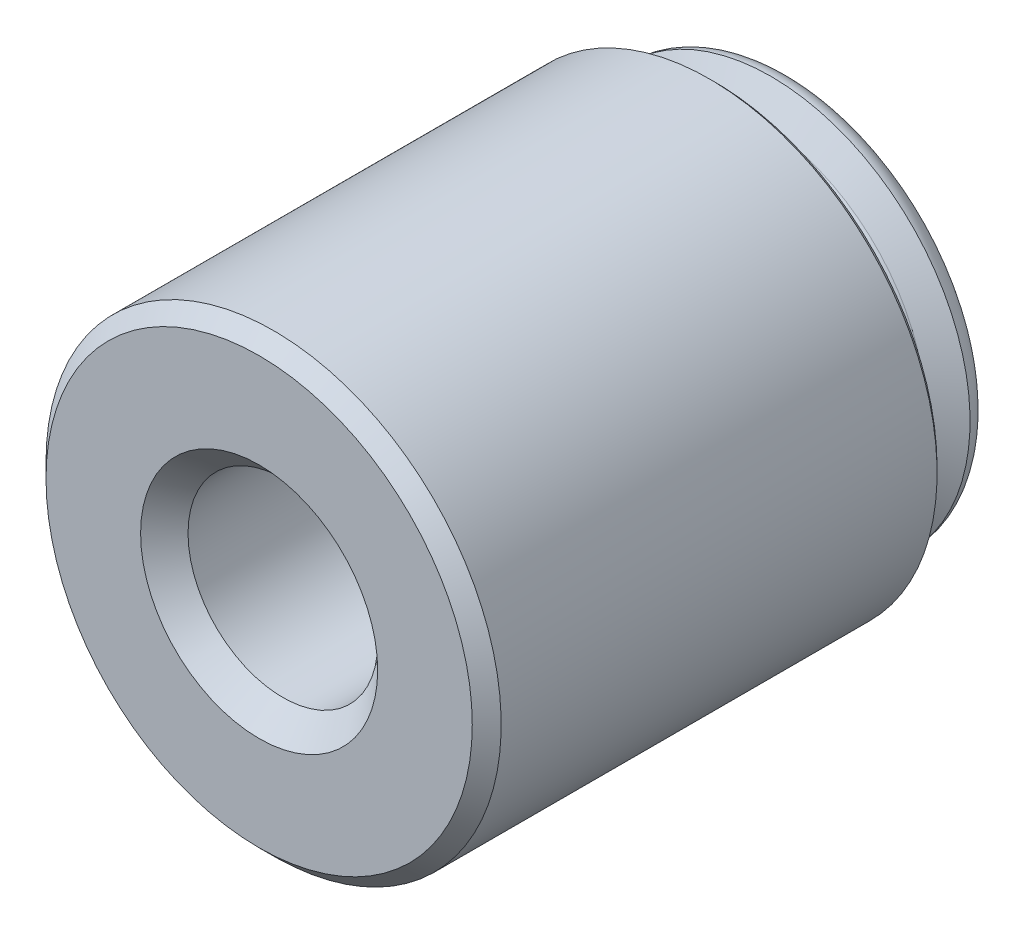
ISO-10303-21;
HEADER;
FILE_DESCRIPTION(('STEP AP214'),'2;1');
FILE_NAME('part.step','',(''),(''),'','','');
FILE_SCHEMA(('AUTOMOTIVE_DESIGN { 1 0 10303 214 1 1 1 1 }'));
ENDSEC;
DATA;
#1=APPLICATION_CONTEXT('core data for automotive mechanical design processes');
#2=APPLICATION_PROTOCOL_DEFINITION('international standard','automotive_design',2000,#1);
#3=PRODUCT_CONTEXT('',#1,'mechanical');
#4=PRODUCT('Part','Part','',(#3));
#5=PRODUCT_RELATED_PRODUCT_CATEGORY('part','',(#4));
#6=PRODUCT_DEFINITION_FORMATION('','',#4);
#7=PRODUCT_DEFINITION_CONTEXT('part definition',#1,'design');
#8=PRODUCT_DEFINITION('design','',#6,#7);
#9=PRODUCT_DEFINITION_SHAPE('','',#8);
#10=(LENGTH_UNIT() NAMED_UNIT(*) SI_UNIT(.MILLI.,.METRE.));
#11=(NAMED_UNIT(*) PLANE_ANGLE_UNIT() SI_UNIT($,.RADIAN.));
#12=(NAMED_UNIT(*) SI_UNIT($,.STERADIAN.) SOLID_ANGLE_UNIT());
#13=UNCERTAINTY_MEASURE_WITH_UNIT(LENGTH_MEASURE(1.E-05),#10,'distance_accuracy_value','');
#14=(GEOMETRIC_REPRESENTATION_CONTEXT(3) GLOBAL_UNCERTAINTY_ASSIGNED_CONTEXT((#13)) GLOBAL_UNIT_ASSIGNED_CONTEXT((#10,
#11,#12)) REPRESENTATION_CONTEXT('',''));
#15=CARTESIAN_POINT('',(0.,0.,0.));
#16=DIRECTION('',(0.,0.,1.));
#17=DIRECTION('',(1.,0.,0.));
#18=AXIS2_PLACEMENT_3D('',#15,#16,#17);
#19=CARTESIAN_POINT('',(0.,0.,8.259600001));
#20=DIRECTION('',(0.,0.,-1.));
#21=DIRECTION('',(-0.387551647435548,0.921847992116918,0.));
#22=AXIS2_PLACEMENT_3D('',#19,#20,#21);
#23=SPHERICAL_SURFACE('',#22,10.);
#24=CARTESIAN_POINT('',(0.,0.,5.778000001));
#25=DIRECTION('',(0.,0.,-1.));
#26=DIRECTION('',(-1.,0.,0.));
#27=AXIS2_PLACEMENT_3D('',#24,#25,#26);
#28=CIRCLE('',#27,9.68719058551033);
#29=CARTESIAN_POINT('',(-3.75428667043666,8.93011719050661,5.778000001));
#30=VERTEX_POINT('',#29);
#31=EDGE_CURVE('E8',#30,#30,#28,.F.);
#32=CARTESIAN_POINT('',(0.,0.,3.73430752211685));
#33=DIRECTION('',(0.,0.,1.));
#34=DIRECTION('',(-0.387551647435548,0.921847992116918,0.));
#35=AXIS2_PLACEMENT_3D('',#32,#33,#34);
#36=CIRCLE('',#35,8.91749561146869);
#37=CARTESIAN_POINT('',(-3.45599011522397,8.22057542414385,3.73430752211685));
#38=VERTEX_POINT('',#37);
#39=EDGE_CURVE('E39',#38,#38,#36,.T.);
#40=CARTESIAN_POINT('',(-3.75428667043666,8.93011719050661,5.778000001));
#41=CARTESIAN_POINT('',(-3.75209449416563,8.92490278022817,5.7559193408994));
#42=CARTESIAN_POINT('',(-3.74987305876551,8.91961877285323,5.73385802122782));
#43=CARTESIAN_POINT('',(-3.74537177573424,8.90891181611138,5.68977509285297));
#44=CARTESIAN_POINT('',(-3.7430919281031,8.90348886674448,5.66775348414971));
#45=CARTESIAN_POINT('',(-3.73847392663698,8.89250427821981,5.62375100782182));
#46=CARTESIAN_POINT('',(-3.736135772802,8.88694263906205,5.60177014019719));
#47=CARTESIAN_POINT('',(-3.73140126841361,8.87568093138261,5.55785017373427));
#48=CARTESIAN_POINT('',(-3.72900491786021,8.86998086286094,5.53591107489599));
#49=CARTESIAN_POINT('',(-3.72415413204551,8.8584425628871,5.49207567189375));
#50=CARTESIAN_POINT('',(-3.72169969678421,8.85260433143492,5.47017936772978));
#51=CARTESIAN_POINT('',(-3.71673285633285,8.84078997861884,5.42643057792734));
#52=CARTESIAN_POINT('',(-3.71422045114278,8.83481385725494,5.40457809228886));
#53=CARTESIAN_POINT('',(-3.70913778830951,8.82272400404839,5.36091796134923));
#54=CARTESIAN_POINT('',(-3.70656753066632,8.81661027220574,5.33911031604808));
#55=CARTESIAN_POINT('',(-3.7013692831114,8.80424548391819,5.29554088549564));
#56=CARTESIAN_POINT('',(-3.69874129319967,8.7979944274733,5.27377910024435));
#57=CARTESIAN_POINT('',(-3.69342770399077,8.78535528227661,5.2303024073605));
#58=CARTESIAN_POINT('',(-3.69074210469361,8.77896719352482,5.20858749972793));
#59=CARTESIAN_POINT('',(-3.685313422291,8.76605428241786,5.1652055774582));
#60=CARTESIAN_POINT('',(-3.68257033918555,8.7595294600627,5.14353856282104));
#61=CARTESIAN_POINT('',(-3.67702681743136,8.74634338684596,5.10025343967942));
#62=CARTESIAN_POINT('',(-3.67422637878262,8.73968213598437,5.07863533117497));
#63=CARTESIAN_POINT('',(-3.66856827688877,8.7262235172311,5.03544903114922));
#64=CARTESIAN_POINT('',(-3.66571061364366,8.71942614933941,5.01388083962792));
#65=CARTESIAN_POINT('',(-3.65993819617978,8.70569561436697,4.97079538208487));
#66=CARTESIAN_POINT('',(-3.65702344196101,8.69876244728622,4.94927811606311));
#67=CARTESIAN_POINT('',(-3.65113697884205,8.68476063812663,4.90629551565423));
#68=CARTESIAN_POINT('',(-3.64816526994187,8.67769199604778,4.88483018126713));
#69=CARTESIAN_POINT('',(-3.6421650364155,8.66341956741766,4.8419524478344));
#70=CARTESIAN_POINT('',(-3.63913651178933,8.65621578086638,4.82054004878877));
#71=CARTESIAN_POINT('',(-3.63302278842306,8.64167340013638,4.77776918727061));
#72=CARTESIAN_POINT('',(-3.62993758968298,8.63433480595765,4.75641072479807));
#73=CARTESIAN_POINT('',(-3.62371066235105,8.61952315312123,4.71374873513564));
#74=CARTESIAN_POINT('',(-3.6205689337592,8.61205009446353,4.69244520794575));
#75=CARTESIAN_POINT('',(-3.61422909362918,8.59696986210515,4.64989408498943));
#76=CARTESIAN_POINT('',(-3.611030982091,8.58936268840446,4.628646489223));
#77=CARTESIAN_POINT('',(-3.60457852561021,8.5740145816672,4.58620822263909));
#78=CARTESIAN_POINT('',(-3.60132418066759,8.56627364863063,4.56501755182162));
#79=CARTESIAN_POINT('',(-3.59475940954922,8.55065838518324,4.52269412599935));
#80=CARTESIAN_POINT('',(-3.59144898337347,8.54278405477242,4.50156137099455));
#81=CARTESIAN_POINT('',(-3.58477220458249,8.52690236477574,4.45935476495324));
#82=CARTESIAN_POINT('',(-3.58140585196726,8.51889500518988,4.43828091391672));
#83=CARTESIAN_POINT('',(-3.57461737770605,8.50274763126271,4.39619310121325));
#84=CARTESIAN_POINT('',(-3.57119525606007,8.49460761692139,4.3751791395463));
#85=CARTESIAN_POINT('',(-3.56429540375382,8.47819531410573,4.33321208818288));
#86=CARTESIAN_POINT('',(-3.56081767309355,8.46992302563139,4.3122589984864));
#87=CARTESIAN_POINT('',(-3.55380676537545,8.45324656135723,4.27041467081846));
#88=CARTESIAN_POINT('',(-3.55027358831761,8.4448423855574,4.249523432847));
#89=CARTESIAN_POINT('',(-3.54315195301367,8.42790253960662,4.20780378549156));
#90=CARTESIAN_POINT('',(-3.53956349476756,8.41936686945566,4.18697537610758));
#91=CARTESIAN_POINT('',(-3.53233146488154,8.40216443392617,4.14538235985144));
#92=CARTESIAN_POINT('',(-3.52868789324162,8.39349766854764,4.12461775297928));
#93=CARTESIAN_POINT('',(-3.52134580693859,8.37603344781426,4.08315331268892));
#94=CARTESIAN_POINT('',(-3.51764729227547,8.36723599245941,4.06245347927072));
#95=CARTESIAN_POINT('',(-3.51019549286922,8.34951080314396,4.0211195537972));
#96=CARTESIAN_POINT('',(-3.50644220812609,8.34058306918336,4.00048546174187));
#97=CARTESIAN_POINT('',(-3.49888104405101,8.32259774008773,3.95928398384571));
#98=CARTESIAN_POINT('',(-3.49507316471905,8.3135401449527,3.93871659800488));
#99=CARTESIAN_POINT('',(-3.48740298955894,8.29529551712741,3.89764949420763));
#100=CARTESIAN_POINT('',(-3.48354069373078,8.28610848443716,3.87714977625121));
#101=CARTESIAN_POINT('',(-3.47576186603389,8.26760541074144,3.83621896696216));
#102=CARTESIAN_POINT('',(-3.47184533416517,8.25828936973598,3.81578787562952));
#103=CARTESIAN_POINT('',(-3.46395821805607,8.23952871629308,3.77499527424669));
#104=CARTESIAN_POINT('',(-3.4599876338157,8.23008410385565,3.7546337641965));
#105=CARTESIAN_POINT('',(-3.45599011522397,8.22057542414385,3.73430752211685));
#106=B_SPLINE_CURVE_WITH_KNOTS('',3,(#40,#41,#42,#43,#44,#45,#46,#47,#48,#49,#50,#51,#52,#53,
#54,#55,#56,#57,#58,#59,#60,#61,#62,#63,#64,#65,#66,#67,#68,#69,#70,#71,#72,#73,#74,#75,#76,#77,
#78,#79,#80,#81,#82,#83,#84,#85,#86,#87,#88,#89,#90,#91,#92,#93,#94,#95,#96,#97,#98,#99,#100,
#101,#102,#103,#104,#105),.UNSPECIFIED.,.F.,.F.,(4,2,2,2,2,2,2,2,2,2,2,2,2,2,2,2,2,2,2,2,2,2,2,
2,2,2,2,2,2,2,2,2,4),(0.,0.0683808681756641,0.136761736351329,0.205142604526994,
0.273523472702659,0.341904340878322,0.410285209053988,0.478666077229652,0.547046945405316,
0.61542781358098,0.683808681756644,0.75218954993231,0.820570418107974,0.888951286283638,
0.957332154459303,1.02571302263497,1.09409389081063,1.1624747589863,1.23085562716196,
1.29923649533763,1.36761736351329,1.43599823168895,1.50437909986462,1.57275996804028,
1.64114083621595,1.70952170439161,1.77790257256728,1.84628344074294,1.91466430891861,
1.98304517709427,2.05142604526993,2.1198069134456,2.18818778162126),.UNSPECIFIED.);
#107=EDGE_CURVE('BSEAM12',#30,#38,#106,.T.);
#108=ORIENTED_EDGE('',*,*,#31,.F.);
#109=ORIENTED_EDGE('',*,*,#39,.T.);
#110=ORIENTED_EDGE('',*,*,#107,.T.);
#111=ORIENTED_EDGE('',*,*,#107,.F.);
#112=EDGE_LOOP('',(#108,#110,#109,#111));
#113=FACE_BOUND('',#112,.T.);
#114=ADVANCED_FACE('F12',(#113),#23,.T.);
#115=CARTESIAN_POINT('',(0.,0.,0.));
#116=DIRECTION('',(0.,0.,-1.));
#117=DIRECTION('',(0.387551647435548,-0.921847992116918,0.));
#118=AXIS2_PLACEMENT_3D('',#115,#116,#117);
#119=CYLINDRICAL_SURFACE('',#118,8.89);
#120=CARTESIAN_POINT('',(0.,0.,3.6193650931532));
#121=DIRECTION('',(0.,0.,1.));
#122=DIRECTION('',(-0.387551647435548,0.921847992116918,0.));
#123=AXIS2_PLACEMENT_3D('',#120,#121,#122);
#124=CIRCLE('',#123,8.89);
#125=CARTESIAN_POINT('',(-3.44533414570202,8.1952286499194,3.6193650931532));
#126=VERTEX_POINT('',#125);
#127=EDGE_CURVE('E37',#126,#126,#124,.F.);
#128=ORIENTED_EDGE('',*,*,#127,.T.);
#129=EDGE_LOOP('',(#128));
#130=FACE_BOUND('',#129,.T.);
#131=CARTESIAN_POINT('',(0.,0.,2.09218090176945));
#132=DIRECTION('',(0.,0.,-1.));
#133=DIRECTION('',(0.387551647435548,-0.921847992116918,0.));
#134=AXIS2_PLACEMENT_3D('',#131,#132,#133);
#135=CIRCLE('',#134,8.89);
#136=CARTESIAN_POINT('',(3.44533414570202,-8.19522864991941,2.09218090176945));
#137=VERTEX_POINT('',#136);
#138=EDGE_CURVE('E34',#137,#137,#135,.F.);
#139=ORIENTED_EDGE('',*,*,#138,.T.);
#140=EDGE_LOOP('',(#139));
#141=FACE_BOUND('',#140,.T.);
#142=ADVANCED_FACE('F245',(#130,#141),#119,.T.);
#143=CARTESIAN_POINT('',(0.,0.,1.9455339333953));
#144=DIRECTION('',(0.,0.,-1.));
#145=DIRECTION('',(0.387551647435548,-0.921847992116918,0.));
#146=AXIS2_PLACEMENT_3D('',#143,#144,#145);
#147=CONICAL_SURFACE('',#146,8.89,1.0471975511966);
#148=CARTESIAN_POINT('',(0.,0.,1.8722104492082));
#149=DIRECTION('',(0.,0.,-1.));
#150=DIRECTION('',(0.387551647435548,-0.921847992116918,0.));
#151=AXIS2_PLACEMENT_3D('',#148,#149,#150);
#152=CIRCLE('',#151,9.017);
#153=CARTESIAN_POINT('',(3.49455320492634,-8.31230334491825,1.8722104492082));
#154=VERTEX_POINT('',#153);
#155=EDGE_CURVE('E15',#154,#154,#152,.T.);
#156=ORIENTED_EDGE('',*,*,#155,.T.);
#157=EDGE_LOOP('',(#156));
#158=FACE_BOUND('',#157,.T.);
#159=CARTESIAN_POINT('',(0.,0.,1.016));
#160=DIRECTION('',(0.,0.,-1.));
#161=DIRECTION('',(0.387551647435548,-0.921847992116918,0.));
#162=AXIS2_PLACEMENT_3D('',#159,#160,#161);
#163=CIRCLE('',#162,10.5);
#164=CARTESIAN_POINT('',(4.06929229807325,-9.67940391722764,1.016));
#165=VERTEX_POINT('',#164);
#166=EDGE_CURVE('E28',#165,#165,#163,.T.);
#167=ORIENTED_EDGE('',*,*,#166,.F.);
#168=EDGE_LOOP('',(#167));
#169=FACE_BOUND('',#168,.T.);
#170=ADVANCED_FACE('F236',(#158,#169),#147,.T.);
#171=CARTESIAN_POINT('',(-4.06929229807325,9.67940391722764,0.));
#172=DIRECTION('',(0.,0.,1.));
#173=DIRECTION('',(-0.387551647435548,0.921847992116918,0.));
#174=AXIS2_PLACEMENT_3D('',#171,#172,#173);
#175=PLANE('',#174);
#176=CARTESIAN_POINT('',(0.,0.,0.));
#177=DIRECTION('',(0.,0.,1.));
#178=DIRECTION('',(-0.387551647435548,0.921847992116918,0.));
#179=AXIS2_PLACEMENT_3D('',#176,#177,#178);
#180=CIRCLE('',#179,9.484);
#181=CARTESIAN_POINT('',(-3.67553982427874,8.74280635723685,0.));
#182=VERTEX_POINT('',#181);
#183=EDGE_CURVE('E31',#182,#182,#180,.F.);
#184=ORIENTED_EDGE('',*,*,#183,.T.);
#185=EDGE_LOOP('',(#184));
#186=FACE_BOUND('',#185,.T.);
#187=ADVANCED_FACE('F227',(#186),#175,.F.);
#188=CARTESIAN_POINT('',(0.,0.,1.016));
#189=DIRECTION('',(0.,0.,1.));
#190=DIRECTION('',(-0.387551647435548,0.921847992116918,0.));
#191=AXIS2_PLACEMENT_3D('',#188,#189,#190);
#192=TOROIDAL_SURFACE('',#191,9.484,1.016);
#193=ORIENTED_EDGE('',*,*,#166,.T.);
#194=EDGE_LOOP('',(#193));
#195=FACE_BOUND('',#194,.T.);
#196=ORIENTED_EDGE('',*,*,#183,.F.);
#197=EDGE_LOOP('',(#196));
#198=FACE_BOUND('',#197,.T.);
#199=ADVANCED_FACE('F218',(#195,#198),#192,.T.);
#200=CARTESIAN_POINT('',(0.,0.,3.6193650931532));
#201=DIRECTION('',(0.,0.,1.));
#202=DIRECTION('',(-0.387551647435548,0.921847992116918,0.));
#203=AXIS2_PLACEMENT_3D('',#200,#201,#202);
#204=TOROIDAL_SURFACE('',#203,9.144,0.254);
#205=ORIENTED_EDGE('',*,*,#39,.F.);
#206=EDGE_LOOP('',(#205));
#207=FACE_BOUND('',#206,.T.);
#208=ORIENTED_EDGE('',*,*,#127,.F.);
#209=EDGE_LOOP('',(#208));
#210=FACE_BOUND('',#209,.T.);
#211=ADVANCED_FACE('F102',(#207,#210),#204,.F.);
#212=CARTESIAN_POINT('',(0.,0.,2.09218090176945));
#213=DIRECTION('',(0.,0.,-1.));
#214=DIRECTION('',(0.387551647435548,-0.921847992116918,0.));
#215=AXIS2_PLACEMENT_3D('',#212,#213,#214);
#216=TOROIDAL_SURFACE('',#215,9.144,0.254);
#217=ORIENTED_EDGE('',*,*,#138,.F.);
#218=EDGE_LOOP('',(#217));
#219=FACE_BOUND('',#218,.T.);
#220=ORIENTED_EDGE('',*,*,#155,.F.);
#221=EDGE_LOOP('',(#220));
#222=FACE_BOUND('',#221,.T.);
#223=ADVANCED_FACE('F97',(#219,#222),#216,.F.);
#224=CARTESIAN_POINT('',(0.,0.,19.000000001));
#225=DIRECTION('',(0.,0.,1.));
#226=DIRECTION('',(1.,0.,0.));
#227=AXIS2_PLACEMENT_3D('',#224,#225,#226);
#228=PLANE('',#227);
#229=CARTESIAN_POINT('',(0.,0.,19.000000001));
#230=DIRECTION('',(0.,0.,1.));
#231=DIRECTION('',(1.,0.,0.));
#232=AXIS2_PLACEMENT_3D('',#229,#230,#231);
#233=CIRCLE('',#232,5.);
#234=CARTESIAN_POINT('',(5.,0.,19.000000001));
#235=VERTEX_POINT('',#234);
#236=EDGE_CURVE('E44',#235,#235,#233,.T.);
#237=ORIENTED_EDGE('',*,*,#236,.T.);
#238=EDGE_LOOP('',(#237));
#239=FACE_BOUND('',#238,.T.);
#240=ADVANCED_FACE('F91',(#239),#228,.T.);
#241=CARTESIAN_POINT('',(0.,0.,19.000000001));
#242=DIRECTION('',(0.,0.,1.));
#243=DIRECTION('',(1.,0.,0.));
#244=AXIS2_PLACEMENT_3D('',#241,#242,#243);
#245=CYLINDRICAL_SURFACE('',#244,5.);
#246=CARTESIAN_POINT('',(0.,0.,26.750000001));
#247=DIRECTION('',(0.,0.,-1.));
#248=DIRECTION('',(-1.,0.,0.));
#249=AXIS2_PLACEMENT_3D('',#246,#247,#248);
#250=CIRCLE('',#249,5.);
#251=CARTESIAN_POINT('',(-5.,0.,26.750000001));
#252=VERTEX_POINT('',#251);
#253=EDGE_CURVE('E24',#252,#252,#250,.F.);
#254=ORIENTED_EDGE('',*,*,#253,.T.);
#255=EDGE_LOOP('',(#254));
#256=FACE_BOUND('',#255,.T.);
#257=ORIENTED_EDGE('',*,*,#236,.F.);
#258=EDGE_LOOP('',(#257));
#259=FACE_BOUND('',#258,.T.);
#260=ADVANCED_FACE('F75',(#256,#259),#245,.F.);
#261=CARTESIAN_POINT('',(0.,0.,26.750000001));
#262=DIRECTION('',(0.,0.,1.));
#263=DIRECTION('',(1.,0.,0.));
#264=AXIS2_PLACEMENT_3D('',#261,#262,#263);
#265=CONICAL_SURFACE('',#264,5.,0.78539816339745);
#266=CARTESIAN_POINT('',(0.,0.,28.000000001));
#267=DIRECTION('',(0.,0.,-1.));
#268=DIRECTION('',(-1.,0.,0.));
#269=AXIS2_PLACEMENT_3D('',#266,#267,#268);
#270=CIRCLE('',#269,6.25);
#271=CARTESIAN_POINT('',(-6.25,0.,28.000000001));
#272=VERTEX_POINT('',#271);
#273=EDGE_CURVE('E19',#272,#272,#270,.T.);
#274=ORIENTED_EDGE('',*,*,#273,.F.);
#275=EDGE_LOOP('',(#274));
#276=FACE_BOUND('',#275,.T.);
#277=ORIENTED_EDGE('',*,*,#253,.F.);
#278=EDGE_LOOP('',(#277));
#279=FACE_BOUND('',#278,.T.);
#280=ADVANCED_FACE('F78',(#276,#279),#265,.F.);
#281=CARTESIAN_POINT('',(0.,0.,28.000000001));
#282=DIRECTION('',(0.,0.,-1.));
#283=DIRECTION('',(-1.,0.,0.));
#284=AXIS2_PLACEMENT_3D('',#281,#282,#283);
#285=PLANE('',#284);
#286=ORIENTED_EDGE('',*,*,#273,.T.);
#287=EDGE_LOOP('',(#286));
#288=FACE_BOUND('',#287,.T.);
#289=CARTESIAN_POINT('',(0.,0.,28.000000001));
#290=DIRECTION('',(0.,0.,-1.));
#291=DIRECTION('',(-1.,0.,0.));
#292=AXIS2_PLACEMENT_3D('',#289,#290,#291);
#293=CIRCLE('',#292,11.238);
#294=CARTESIAN_POINT('',(-11.238,0.,28.000000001));
#295=VERTEX_POINT('',#294);
#296=EDGE_CURVE('E70',#295,#295,#293,.F.);
#297=ORIENTED_EDGE('',*,*,#296,.T.);
#298=EDGE_LOOP('',(#297));
#299=FACE_BOUND('',#298,.T.);
#300=ADVANCED_FACE('F80',(#288,#299),#285,.F.);
#301=CARTESIAN_POINT('',(0.,0.,27.238000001));
#302=DIRECTION('',(0.,0.,-1.));
#303=DIRECTION('',(-1.,0.,0.));
#304=AXIS2_PLACEMENT_3D('',#301,#302,#303);
#305=CONICAL_SURFACE('',#304,12.,0.785398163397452);
#306=ORIENTED_EDGE('',*,*,#296,.F.);
#307=EDGE_LOOP('',(#306));
#308=FACE_BOUND('',#307,.T.);
#309=CARTESIAN_POINT('',(0.,0.,27.238000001));
#310=DIRECTION('',(0.,0.,-1.));
#311=DIRECTION('',(-1.,0.,0.));
#312=AXIS2_PLACEMENT_3D('',#309,#310,#311);
#313=CIRCLE('',#312,12.);
#314=CARTESIAN_POINT('',(-12.,0.,27.238000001));
#315=VERTEX_POINT('',#314);
#316=EDGE_CURVE('E67',#315,#315,#313,.T.);
#317=ORIENTED_EDGE('',*,*,#316,.F.);
#318=EDGE_LOOP('',(#317));
#319=FACE_BOUND('',#318,.T.);
#320=ADVANCED_FACE('F88',(#308,#319),#305,.T.);
#321=CARTESIAN_POINT('',(0.,0.,28.000000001));
#322=DIRECTION('',(0.,0.,-1.));
#323=DIRECTION('',(-1.,0.,0.));
#324=AXIS2_PLACEMENT_3D('',#321,#322,#323);
#325=CYLINDRICAL_SURFACE('',#324,12.);
#326=ORIENTED_EDGE('',*,*,#316,.T.);
#327=EDGE_LOOP('',(#326));
#328=FACE_BOUND('',#327,.T.);
#329=CARTESIAN_POINT('',(0.,0.,4.254000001));
#330=DIRECTION('',(0.,0.,-1.));
#331=DIRECTION('',(-1.,0.,0.));
#332=AXIS2_PLACEMENT_3D('',#329,#330,#331);
#333=CIRCLE('',#332,12.);
#334=CARTESIAN_POINT('',(-12.,0.,4.254000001));
#335=VERTEX_POINT('',#334);
#336=EDGE_CURVE('E64',#335,#335,#333,.F.);
#337=ORIENTED_EDGE('',*,*,#336,.T.);
#338=EDGE_LOOP('',(#337));
#339=FACE_BOUND('',#338,.T.);
#340=ADVANCED_FACE('F119',(#328,#339),#325,.T.);
#341=CARTESIAN_POINT('',(0.,0.,4.000000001));
#342=DIRECTION('',(0.,0.,1.));
#343=DIRECTION('',(1.,0.,0.));
#344=AXIS2_PLACEMENT_3D('',#341,#342,#343);
#345=CONICAL_SURFACE('',#344,11.746,0.785398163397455);
#346=ORIENTED_EDGE('',*,*,#336,.F.);
#347=EDGE_LOOP('',(#346));
#348=FACE_BOUND('',#347,.T.);
#349=CARTESIAN_POINT('',(0.,0.,4.000000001));
#350=DIRECTION('',(0.,0.,-1.));
#351=DIRECTION('',(-1.,0.,0.));
#352=AXIS2_PLACEMENT_3D('',#349,#350,#351);
#353=CIRCLE('',#352,11.746);
#354=CARTESIAN_POINT('',(-11.746,0.,4.000000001));
#355=VERTEX_POINT('',#354);
#356=EDGE_CURVE('E58',#355,#355,#353,.T.);
#357=ORIENTED_EDGE('',*,*,#356,.F.);
#358=EDGE_LOOP('',(#357));
#359=FACE_BOUND('',#358,.T.);
#360=ADVANCED_FACE('F117',(#348,#359),#345,.T.);
#361=CARTESIAN_POINT('',(0.,0.,4.000000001));
#362=DIRECTION('',(0.,0.,-1.));
#363=DIRECTION('',(-1.,0.,0.));
#364=AXIS2_PLACEMENT_3D('',#361,#362,#363);
#365=PLANE('',#364);
#366=CARTESIAN_POINT('',(0.,0.,4.000000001));
#367=DIRECTION('',(0.,0.,-1.));
#368=DIRECTION('',(-1.,0.,0.));
#369=AXIS2_PLACEMENT_3D('',#366,#367,#368);
#370=CIRCLE('',#369,10.3124);
#371=CARTESIAN_POINT('',(-10.3124,0.,4.000000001));
#372=VERTEX_POINT('',#371);
#373=EDGE_CURVE('E61',#372,#372,#370,.F.);
#374=ORIENTED_EDGE('',*,*,#373,.T.);
#375=EDGE_LOOP('',(#374));
#376=FACE_BOUND('',#375,.T.);
#377=ORIENTED_EDGE('',*,*,#356,.T.);
#378=EDGE_LOOP('',(#377));
#379=FACE_BOUND('',#378,.T.);
#380=ADVANCED_FACE('F114',(#376,#379),#365,.T.);
#381=CARTESIAN_POINT('',(0.,0.,4.254000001));
#382=DIRECTION('',(0.,0.,-1.));
#383=DIRECTION('',(-1.,0.,0.));
#384=AXIS2_PLACEMENT_3D('',#381,#382,#383);
#385=CONICAL_SURFACE('',#384,10.0584,0.785398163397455);
#386=ORIENTED_EDGE('',*,*,#373,.F.);
#387=EDGE_LOOP('',(#386));
#388=FACE_BOUND('',#387,.T.);
#389=CARTESIAN_POINT('',(0.,0.,4.254000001));
#390=DIRECTION('',(0.,0.,-1.));
#391=DIRECTION('',(-1.,0.,0.));
#392=AXIS2_PLACEMENT_3D('',#389,#390,#391);
#393=CIRCLE('',#392,10.0584);
#394=CARTESIAN_POINT('',(-10.0584,0.,4.254000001));
#395=VERTEX_POINT('',#394);
#396=EDGE_CURVE('E53',#395,#395,#393,.T.);
#397=ORIENTED_EDGE('',*,*,#396,.F.);
#398=EDGE_LOOP('',(#397));
#399=FACE_BOUND('',#398,.T.);
#400=ADVANCED_FACE('F111',(#388,#399),#385,.F.);
#401=CARTESIAN_POINT('',(0.,0.,12.280400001));
#402=DIRECTION('',(0.,0.,-1.));
#403=DIRECTION('',(-1.,0.,0.));
#404=AXIS2_PLACEMENT_3D('',#401,#402,#403);
#405=CYLINDRICAL_SURFACE('',#404,10.0584);
#406=ORIENTED_EDGE('',*,*,#396,.T.);
#407=EDGE_LOOP('',(#406));
#408=FACE_BOUND('',#407,.T.);
#409=CARTESIAN_POINT('',(0.,0.,5.778000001));
#410=DIRECTION('',(0.,0.,-1.));
#411=DIRECTION('',(-1.,0.,0.));
#412=AXIS2_PLACEMENT_3D('',#409,#410,#411);
#413=CIRCLE('',#412,10.0584);
#414=CARTESIAN_POINT('',(-10.0584,0.,5.778000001));
#415=VERTEX_POINT('',#414);
#416=EDGE_CURVE('E48',#415,#415,#413,.F.);
#417=ORIENTED_EDGE('',*,*,#416,.T.);
#418=EDGE_LOOP('',(#417));
#419=FACE_BOUND('',#418,.T.);
#420=ADVANCED_FACE('F108',(#408,#419),#405,.F.);
#421=CARTESIAN_POINT('',(0.,0.,5.778000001));
#422=DIRECTION('',(0.,0.,-1.));
#423=DIRECTION('',(-1.,0.,0.));
#424=AXIS2_PLACEMENT_3D('',#421,#422,#423);
#425=PLANE('',#424);
#426=ORIENTED_EDGE('',*,*,#416,.F.);
#427=EDGE_LOOP('',(#426));
#428=FACE_BOUND('',#427,.T.);
#429=ORIENTED_EDGE('',*,*,#31,.T.);
#430=EDGE_LOOP('',(#429));
#431=FACE_BOUND('',#430,.T.);
#432=ADVANCED_FACE('F105',(#428,#431),#425,.T.);
#433=CLOSED_SHELL('',(#114,#142,#170,#187,#199,#211,#223,#240,#260,#280,#300,#320,#340,#360,
#380,#400,#420,#432));
#434=MANIFOLD_SOLID_BREP('B1',#433);
#435=ADVANCED_BREP_SHAPE_REPRESENTATION('',(#18,#434),#14);
#436=SHAPE_DEFINITION_REPRESENTATION(#9,#435);
ENDSEC;
END-ISO-10303-21;
